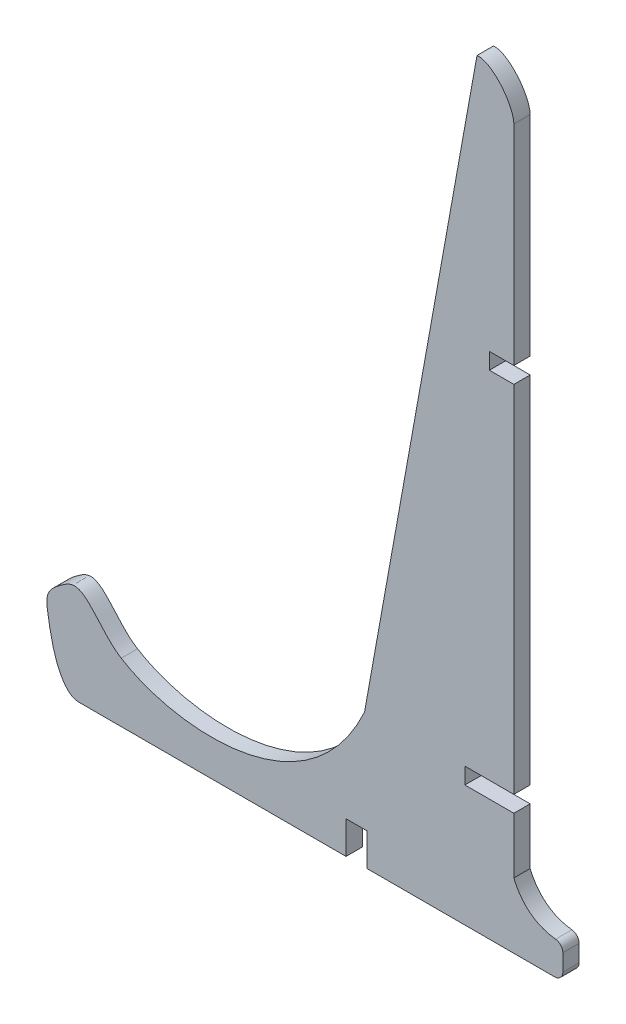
ISO-10303-21;
HEADER;
FILE_DESCRIPTION(('STEP AP214'),'2;1');
FILE_NAME('part.step','',(''),(''),'','','');
FILE_SCHEMA(('AUTOMOTIVE_DESIGN { 1 0 10303 214 1 1 1 1 }'));
ENDSEC;
DATA;
#1=APPLICATION_CONTEXT('core data for automotive mechanical design processes');
#2=APPLICATION_PROTOCOL_DEFINITION('international standard','automotive_design',2000,#1);
#3=PRODUCT_CONTEXT('',#1,'mechanical');
#4=PRODUCT('Part','Part','',(#3));
#5=PRODUCT_RELATED_PRODUCT_CATEGORY('part','',(#4));
#6=PRODUCT_DEFINITION_FORMATION('','',#4);
#7=PRODUCT_DEFINITION_CONTEXT('part definition',#1,'design');
#8=PRODUCT_DEFINITION('design','',#6,#7);
#9=PRODUCT_DEFINITION_SHAPE('','',#8);
#10=(LENGTH_UNIT() NAMED_UNIT(*) SI_UNIT(.MILLI.,.METRE.));
#11=(NAMED_UNIT(*) PLANE_ANGLE_UNIT() SI_UNIT($,.RADIAN.));
#12=(NAMED_UNIT(*) SI_UNIT($,.STERADIAN.) SOLID_ANGLE_UNIT());
#13=UNCERTAINTY_MEASURE_WITH_UNIT(LENGTH_MEASURE(1.E-05),#10,'distance_accuracy_value','');
#14=(GEOMETRIC_REPRESENTATION_CONTEXT(3) GLOBAL_UNCERTAINTY_ASSIGNED_CONTEXT((#13)) GLOBAL_UNIT_ASSIGNED_CONTEXT((#10,
#11,#12)) REPRESENTATION_CONTEXT('',''));
#15=CARTESIAN_POINT('',(0.,0.,0.));
#16=DIRECTION('',(0.,0.,1.));
#17=DIRECTION('',(1.,0.,0.));
#18=AXIS2_PLACEMENT_3D('',#15,#16,#17);
#19=CARTESIAN_POINT('',(-5.00000000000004,0.,10.));
#20=DIRECTION('',(0.,1.,0.));
#21=DIRECTION('',(-1.,0.,0.));
#22=AXIS2_PLACEMENT_3D('',#19,#20,#21);
#23=PLANE('',#22);
#24=DIRECTION('',(1.,0.,0.));
#25=VECTOR('',#24,1.);
#26=CARTESIAN_POINT('',(-5.00000000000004,0.,0.));
#27=LINE('',#26,#25);
#28=CARTESIAN_POINT('',(-296.094580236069,0.,0.));
#29=VERTEX_POINT('',#28);
#30=CARTESIAN_POINT('',(-132.8,0.,0.));
#31=VERTEX_POINT('',#30);
#32=EDGE_CURVE('E206',#29,#31,#27,.T.);
#33=ORIENTED_EDGE('',*,*,#32,.T.);
#34=DIRECTION('',(0.,0.,1.));
#35=VECTOR('',#34,1.);
#36=CARTESIAN_POINT('',(-132.8,0.,0.));
#37=LINE('',#36,#35);
#38=CARTESIAN_POINT('',(-132.8,0.,10.));
#39=VERTEX_POINT('',#38);
#40=EDGE_CURVE('E190',#31,#39,#37,.T.);
#41=ORIENTED_EDGE('',*,*,#40,.T.);
#42=DIRECTION('',(1.,0.,0.));
#43=VECTOR('',#42,1.);
#44=CARTESIAN_POINT('',(-5.00000000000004,0.,10.));
#45=LINE('',#44,#43);
#46=CARTESIAN_POINT('',(-296.094580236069,0.,10.));
#47=VERTEX_POINT('',#46);
#48=EDGE_CURVE('E363',#47,#39,#45,.T.);
#49=ORIENTED_EDGE('',*,*,#48,.F.);
#50=DIRECTION('',(0.,0.,-1.));
#51=VECTOR('',#50,1.);
#52=CARTESIAN_POINT('',(-296.094580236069,0.,10.));
#53=LINE('',#52,#51);
#54=EDGE_CURVE('E213',#47,#29,#53,.T.);
#55=ORIENTED_EDGE('',*,*,#54,.T.);
#56=EDGE_LOOP('',(#33,#41,#49,#55));
#57=FACE_BOUND('',#56,.T.);
#58=ADVANCED_FACE('F34',(#57),#23,.F.);
#59=CARTESIAN_POINT('',(-30.,40.,10.));
#60=DIRECTION('',(-1.,0.,0.));
#61=DIRECTION('',(0.,0.,1.));
#62=AXIS2_PLACEMENT_3D('',#59,#60,#61);
#63=PLANE('',#62);
#64=DIRECTION('',(0.,1.,0.));
#65=VECTOR('',#64,1.);
#66=CARTESIAN_POINT('',(-30.,40.,0.));
#67=LINE('',#66,#65);
#68=CARTESIAN_POINT('',(-30.,40.,0.));
#69=VERTEX_POINT('',#68);
#70=CARTESIAN_POINT('',(-30.,74.3168641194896,0.));
#71=VERTEX_POINT('',#70);
#72=EDGE_CURVE('E231',#69,#71,#67,.T.);
#73=ORIENTED_EDGE('',*,*,#72,.T.);
#74=DIRECTION('',(0.,0.,1.));
#75=VECTOR('',#74,1.);
#76=CARTESIAN_POINT('',(-30.,74.3168641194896,0.));
#77=LINE('',#76,#75);
#78=CARTESIAN_POINT('',(-30.,74.3168641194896,10.));
#79=VERTEX_POINT('',#78);
#80=EDGE_CURVE('E296',#71,#79,#77,.T.);
#81=ORIENTED_EDGE('',*,*,#80,.T.);
#82=DIRECTION('',(0.,1.,0.));
#83=VECTOR('',#82,1.);
#84=CARTESIAN_POINT('',(-30.,40.,10.));
#85=LINE('',#84,#83);
#86=CARTESIAN_POINT('',(-30.,40.,10.));
#87=VERTEX_POINT('',#86);
#88=EDGE_CURVE('E243',#87,#79,#85,.T.);
#89=ORIENTED_EDGE('',*,*,#88,.F.);
#90=DIRECTION('',(0.,0.,-1.));
#91=VECTOR('',#90,1.);
#92=CARTESIAN_POINT('',(-30.,40.,10.));
#93=LINE('',#92,#91);
#94=EDGE_CURVE('E242',#87,#69,#93,.T.);
#95=ORIENTED_EDGE('',*,*,#94,.T.);
#96=EDGE_LOOP('',(#73,#81,#89,#95));
#97=FACE_BOUND('',#96,.T.);
#98=ADVANCED_FACE('F381',(#97),#63,.F.);
#99=CARTESIAN_POINT('',(-30.,84.3168641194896,10.));
#100=VERTEX_POINT('',#99);
#101=CARTESIAN_POINT('',(-30.,301.863689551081,10.));
#102=VERTEX_POINT('',#101);
#103=EDGE_CURVE('E302',#100,#102,#85,.T.);
#104=ORIENTED_EDGE('',*,*,#103,.F.);
#105=DIRECTION('',(0.,0.,1.));
#106=VECTOR('',#105,1.);
#107=CARTESIAN_POINT('',(-30.,84.3168641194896,0.));
#108=LINE('',#107,#106);
#109=CARTESIAN_POINT('',(-30.,84.3168641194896,0.));
#110=VERTEX_POINT('',#109);
#111=EDGE_CURVE('E402',#110,#100,#108,.T.);
#112=ORIENTED_EDGE('',*,*,#111,.F.);
#113=CARTESIAN_POINT('',(-30.,301.863689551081,0.));
#114=VERTEX_POINT('',#113);
#115=EDGE_CURVE('E238',#110,#114,#67,.T.);
#116=ORIENTED_EDGE('',*,*,#115,.T.);
#117=DIRECTION('',(0.,0.,1.));
#118=VECTOR('',#117,1.);
#119=CARTESIAN_POINT('',(-30.,301.863689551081,0.));
#120=LINE('',#119,#118);
#121=EDGE_CURVE('E424',#114,#102,#120,.T.);
#122=ORIENTED_EDGE('',*,*,#121,.T.);
#123=EDGE_LOOP('',(#104,#112,#116,#122));
#124=FACE_BOUND('',#123,.T.);
#125=ADVANCED_FACE('F467',(#124),#63,.F.);
#126=CARTESIAN_POINT('',(-30.,440.,10.));
#127=CARTESIAN_POINT('',(-30.2000133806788,449.899956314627,10.));
#128=CARTESIAN_POINT('',(-43.2967119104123,466.279484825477,10.));
#129=CARTESIAN_POINT('',(-52.5745711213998,465.090015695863,10.));
#130=B_SPLINE_CURVE_WITH_KNOTS('',3,(#126,#127,#128,#129),.UNSPECIFIED.,.F.,.F.,(4,4),(0.,1.),.UNSPECIFIED.);
#131=DIRECTION('',(0.,0.,-1.));
#132=VECTOR('',#131,1.);
#133=SURFACE_OF_LINEAR_EXTRUSION('',#130,#132);
#134=CARTESIAN_POINT('',(-30.,440.,0.));
#135=CARTESIAN_POINT('',(-30.2000133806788,449.899956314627,0.));
#136=CARTESIAN_POINT('',(-43.2967119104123,466.279484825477,0.));
#137=CARTESIAN_POINT('',(-52.5745711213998,465.090015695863,0.));
#138=B_SPLINE_CURVE_WITH_KNOTS('',3,(#134,#135,#136,#137),.UNSPECIFIED.,.F.,.F.,(4,4),(0.,1.),.UNSPECIFIED.);
#139=CARTESIAN_POINT('',(-30.,440.,0.));
#140=VERTEX_POINT('',#139);
#141=CARTESIAN_POINT('',(-52.5745711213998,465.090015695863,0.));
#142=VERTEX_POINT('',#141);
#143=EDGE_CURVE('E279',#140,#142,#138,.T.);
#144=ORIENTED_EDGE('',*,*,#143,.T.);
#145=DIRECTION('',(0.,0.,-1.));
#146=VECTOR('',#145,1.);
#147=CARTESIAN_POINT('',(-52.5745711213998,465.090015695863,10.));
#148=LINE('',#147,#146);
#149=CARTESIAN_POINT('',(-52.5745711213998,465.090015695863,10.));
#150=VERTEX_POINT('',#149);
#151=EDGE_CURVE('E11',#150,#142,#148,.T.);
#152=ORIENTED_EDGE('',*,*,#151,.F.);
#153=CARTESIAN_POINT('',(-30.,440.,10.));
#154=VERTEX_POINT('',#153);
#155=EDGE_CURVE('E237',#154,#150,#130,.T.);
#156=ORIENTED_EDGE('',*,*,#155,.F.);
#157=DIRECTION('',(0.,0.,-1.));
#158=VECTOR('',#157,1.);
#159=CARTESIAN_POINT('',(-30.,440.,10.));
#160=LINE('',#159,#158);
#161=EDGE_CURVE('E239',#154,#140,#160,.T.);
#162=ORIENTED_EDGE('',*,*,#161,.T.);
#163=EDGE_LOOP('',(#144,#152,#156,#162));
#164=FACE_BOUND('',#163,.T.);
#165=ADVANCED_FACE('F36',(#164),#133,.F.);
#166=CARTESIAN_POINT('',(-121.474297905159,82.2554750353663,10.));
#167=DIRECTION('',(0.984188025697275,-0.177126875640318,0.));
#168=DIRECTION('',(0.177126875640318,0.984188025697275,0.));
#169=AXIS2_PLACEMENT_3D('',#166,#167,#168);
#170=PLANE('',#169);
#171=DIRECTION('',(-0.177126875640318,-0.984188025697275,0.));
#172=VECTOR('',#171,1.);
#173=CARTESIAN_POINT('',(-121.474297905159,82.2554750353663,0.));
#174=LINE('',#173,#172);
#175=CARTESIAN_POINT('',(-121.474297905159,82.2554750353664,0.));
#176=VERTEX_POINT('',#175);
#177=EDGE_CURVE('E276',#142,#176,#174,.T.);
#178=ORIENTED_EDGE('',*,*,#177,.T.);
#179=DIRECTION('',(0.,0.,-1.));
#180=VECTOR('',#179,1.);
#181=CARTESIAN_POINT('',(-121.474297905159,82.2554750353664,10.));
#182=LINE('',#181,#180);
#183=CARTESIAN_POINT('',(-121.474297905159,82.2554750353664,10.));
#184=VERTEX_POINT('',#183);
#185=EDGE_CURVE('E43',#184,#176,#182,.T.);
#186=ORIENTED_EDGE('',*,*,#185,.F.);
#187=DIRECTION('',(-0.177126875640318,-0.984188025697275,0.));
#188=VECTOR('',#187,1.);
#189=CARTESIAN_POINT('',(-121.474297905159,82.2554750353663,10.));
#190=LINE('',#189,#188);
#191=EDGE_CURVE('E435',#150,#184,#190,.T.);
#192=ORIENTED_EDGE('',*,*,#191,.F.);
#193=ORIENTED_EDGE('',*,*,#151,.T.);
#194=EDGE_LOOP('',(#178,#186,#192,#193));
#195=FACE_BOUND('',#194,.T.);
#196=ADVANCED_FACE('F480',(#195),#170,.F.);
#197=CARTESIAN_POINT('',(-121.474297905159,82.2554750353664,10.));
#198=CARTESIAN_POINT('',(-155.314196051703,8.32180073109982,10.));
#199=CARTESIAN_POINT('',(-237.12193313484,15.1791710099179,10.));
#200=CARTESIAN_POINT('',(-270.510328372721,36.34298683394,10.));
#201=B_SPLINE_CURVE_WITH_KNOTS('',3,(#197,#198,#199,#200),.UNSPECIFIED.,.F.,.F.,(4,4),(0.,1.),.UNSPECIFIED.);
#202=DIRECTION('',(0.,0.,-1.));
#203=VECTOR('',#202,1.);
#204=SURFACE_OF_LINEAR_EXTRUSION('',#201,#203);
#205=CARTESIAN_POINT('',(-121.474297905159,82.2554750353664,0.));
#206=CARTESIAN_POINT('',(-155.314196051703,8.32180073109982,0.));
#207=CARTESIAN_POINT('',(-237.12193313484,15.1791710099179,0.));
#208=CARTESIAN_POINT('',(-270.510328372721,36.34298683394,0.));
#209=B_SPLINE_CURVE_WITH_KNOTS('',3,(#205,#206,#207,#208),.UNSPECIFIED.,.F.,.F.,(4,4),(0.,1.),.UNSPECIFIED.);
#210=CARTESIAN_POINT('',(-270.510328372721,36.34298683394,0.));
#211=VERTEX_POINT('',#210);
#212=EDGE_CURVE('E271',#176,#211,#209,.T.);
#213=ORIENTED_EDGE('',*,*,#212,.T.);
#214=DIRECTION('',(0.,0.,-1.));
#215=VECTOR('',#214,1.);
#216=CARTESIAN_POINT('',(-270.510328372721,36.34298683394,10.));
#217=LINE('',#216,#215);
#218=CARTESIAN_POINT('',(-270.510328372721,36.34298683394,10.));
#219=VERTEX_POINT('',#218);
#220=EDGE_CURVE('E262',#219,#211,#217,.T.);
#221=ORIENTED_EDGE('',*,*,#220,.F.);
#222=EDGE_CURVE('E272',#184,#219,#201,.T.);
#223=ORIENTED_EDGE('',*,*,#222,.F.);
#224=ORIENTED_EDGE('',*,*,#185,.T.);
#225=EDGE_LOOP('',(#213,#221,#223,#224));
#226=FACE_BOUND('',#225,.T.);
#227=ADVANCED_FACE('F269',(#226),#204,.F.);
#228=CARTESIAN_POINT('',(-270.510328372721,36.34298683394,10.));
#229=CARTESIAN_POINT('',(-282.427783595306,43.3712296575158,10.));
#230=CARTESIAN_POINT('',(-293.009487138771,66.3482725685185,10.));
#231=CARTESIAN_POINT('',(-316.760306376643,50.5589723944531,10.));
#232=CARTESIAN_POINT('',(-317.167872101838,46.009028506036,10.));
#233=CARTESIAN_POINT('',(-312.425113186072,20.4822850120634,10.));
#234=CARTESIAN_POINT('',(-308.578938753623,8.26962731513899,10.));
#235=CARTESIAN_POINT('',(-303.117965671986,2.88156920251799,10.));
#236=B_SPLINE_CURVE_WITH_KNOTS('',3,(#228,#229,#230,#231,#232,#233,#234,#235),.UNSPECIFIED.,.F.,
.F.,(4,1,1,1,1,4),(0.0415446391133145,0.309810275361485,0.380871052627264,0.710898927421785,
0.77693717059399,1.),.UNSPECIFIED.);
#237=DIRECTION('',(0.,0.,-1.));
#238=VECTOR('',#237,1.);
#239=SURFACE_OF_LINEAR_EXTRUSION('',#236,#238);
#240=CARTESIAN_POINT('',(-270.510328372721,36.34298683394,0.));
#241=CARTESIAN_POINT('',(-282.427783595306,43.3712296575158,0.));
#242=CARTESIAN_POINT('',(-293.009487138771,66.3482725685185,0.));
#243=CARTESIAN_POINT('',(-316.760306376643,50.5589723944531,0.));
#244=CARTESIAN_POINT('',(-317.167872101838,46.009028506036,0.));
#245=CARTESIAN_POINT('',(-312.425113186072,20.4822850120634,0.));
#246=CARTESIAN_POINT('',(-308.578938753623,8.26962731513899,0.));
#247=CARTESIAN_POINT('',(-303.117965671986,2.88156920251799,0.));
#248=B_SPLINE_CURVE_WITH_KNOTS('',3,(#240,#241,#242,#243,#244,#245,#246,#247),.UNSPECIFIED.,.F.,
.F.,(4,1,1,1,1,4),(0.0415446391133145,0.309810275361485,0.380871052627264,0.710898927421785,
0.77693717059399,1.),.UNSPECIFIED.);
#249=CARTESIAN_POINT('',(-303.117965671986,2.88156920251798,0.));
#250=VERTEX_POINT('',#249);
#251=EDGE_CURVE('E277',#211,#250,#248,.T.);
#252=ORIENTED_EDGE('',*,*,#251,.T.);
#253=DIRECTION('',(0.,0.,-1.));
#254=VECTOR('',#253,1.);
#255=CARTESIAN_POINT('',(-303.117965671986,2.88156920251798,10.));
#256=LINE('',#255,#254);
#257=CARTESIAN_POINT('',(-303.117965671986,2.88156920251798,10.));
#258=VERTEX_POINT('',#257);
#259=EDGE_CURVE('E259',#258,#250,#256,.T.);
#260=ORIENTED_EDGE('',*,*,#259,.F.);
#261=EDGE_CURVE('E348',#219,#258,#236,.T.);
#262=ORIENTED_EDGE('',*,*,#261,.F.);
#263=ORIENTED_EDGE('',*,*,#220,.T.);
#264=EDGE_LOOP('',(#252,#260,#262,#263));
#265=FACE_BOUND('',#264,.T.);
#266=ADVANCED_FACE('F341',(#265),#239,.F.);
#267=CARTESIAN_POINT('',(-296.094580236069,9.99999999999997,10.));
#268=DIRECTION('',(0.,0.,-1.));
#269=DIRECTION('',(-1.,0.,0.));
#270=AXIS2_PLACEMENT_3D('',#267,#268,#269);
#271=CYLINDRICAL_SURFACE('',#270,10.);
#272=CARTESIAN_POINT('',(-296.094580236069,9.99999999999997,0.));
#273=DIRECTION('',(0.,0.,1.));
#274=DIRECTION('',(-1.,0.,0.));
#275=AXIS2_PLACEMENT_3D('',#272,#273,#274);
#276=CIRCLE('',#275,10.);
#277=EDGE_CURVE('E219',#250,#29,#276,.T.);
#278=ORIENTED_EDGE('',*,*,#277,.T.);
#279=ORIENTED_EDGE('',*,*,#54,.F.);
#280=CARTESIAN_POINT('',(-296.094580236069,9.99999999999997,10.));
#281=DIRECTION('',(0.,0.,1.));
#282=DIRECTION('',(-1.,0.,0.));
#283=AXIS2_PLACEMENT_3D('',#280,#281,#282);
#284=CIRCLE('',#283,10.);
#285=EDGE_CURVE('E353',#258,#47,#284,.T.);
#286=ORIENTED_EDGE('',*,*,#285,.F.);
#287=ORIENTED_EDGE('',*,*,#259,.T.);
#288=EDGE_LOOP('',(#278,#279,#286,#287));
#289=FACE_BOUND('',#288,.T.);
#290=ADVANCED_FACE('F337',(#289),#271,.T.);
#291=CARTESIAN_POINT('',(-120.,0.,10.));
#292=VERTEX_POINT('',#291);
#293=CARTESIAN_POINT('',(-5.00000000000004,0.,10.));
#294=VERTEX_POINT('',#293);
#295=EDGE_CURVE('E362',#292,#294,#45,.T.);
#296=ORIENTED_EDGE('',*,*,#295,.F.);
#297=DIRECTION('',(0.,0.,1.));
#298=VECTOR('',#297,1.);
#299=CARTESIAN_POINT('',(-120.,0.,0.));
#300=LINE('',#299,#298);
#301=CARTESIAN_POINT('',(-120.,0.,0.));
#302=VERTEX_POINT('',#301);
#303=EDGE_CURVE('E200',#302,#292,#300,.T.);
#304=ORIENTED_EDGE('',*,*,#303,.F.);
#305=CARTESIAN_POINT('',(-5.00000000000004,0.,0.));
#306=VERTEX_POINT('',#305);
#307=EDGE_CURVE('E215',#302,#306,#27,.T.);
#308=ORIENTED_EDGE('',*,*,#307,.T.);
#309=DIRECTION('',(0.,0.,-1.));
#310=VECTOR('',#309,1.);
#311=CARTESIAN_POINT('',(-5.00000000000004,0.,10.));
#312=LINE('',#311,#310);
#313=EDGE_CURVE('E255',#294,#306,#312,.T.);
#314=ORIENTED_EDGE('',*,*,#313,.F.);
#315=EDGE_LOOP('',(#296,#304,#308,#314));
#316=FACE_BOUND('',#315,.T.);
#317=ADVANCED_FACE('F333',(#316),#23,.F.);
#318=CARTESIAN_POINT('',(-5.,5.,10.));
#319=DIRECTION('',(0.,0.,-1.));
#320=DIRECTION('',(-1.,0.,0.));
#321=AXIS2_PLACEMENT_3D('',#318,#319,#320);
#322=CYLINDRICAL_SURFACE('',#321,5.);
#323=CARTESIAN_POINT('',(-5.,5.,0.));
#324=DIRECTION('',(0.,0.,1.));
#325=DIRECTION('',(1.,0.,0.));
#326=AXIS2_PLACEMENT_3D('',#323,#324,#325);
#327=CIRCLE('',#326,5.);
#328=CARTESIAN_POINT('',(0.,5.00000000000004,0.));
#329=VERTEX_POINT('',#328);
#330=EDGE_CURVE('E214',#306,#329,#327,.T.);
#331=ORIENTED_EDGE('',*,*,#330,.T.);
#332=DIRECTION('',(0.,0.,-1.));
#333=VECTOR('',#332,1.);
#334=CARTESIAN_POINT('',(0.,5.00000000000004,10.));
#335=LINE('',#334,#333);
#336=CARTESIAN_POINT('',(0.,5.00000000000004,10.));
#337=VERTEX_POINT('',#336);
#338=EDGE_CURVE('E252',#337,#329,#335,.T.);
#339=ORIENTED_EDGE('',*,*,#338,.F.);
#340=CARTESIAN_POINT('',(-5.,5.,10.));
#341=DIRECTION('',(0.,0.,1.));
#342=DIRECTION('',(1.,0.,0.));
#343=AXIS2_PLACEMENT_3D('',#340,#341,#342);
#344=CIRCLE('',#343,5.);
#345=EDGE_CURVE('E365',#294,#337,#344,.T.);
#346=ORIENTED_EDGE('',*,*,#345,.F.);
#347=ORIENTED_EDGE('',*,*,#313,.T.);
#348=EDGE_LOOP('',(#331,#339,#346,#347));
#349=FACE_BOUND('',#348,.T.);
#350=ADVANCED_FACE('F329',(#349),#322,.T.);
#351=CARTESIAN_POINT('',(0.,15.3046623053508,10.));
#352=DIRECTION('',(-1.,0.,0.));
#353=DIRECTION('',(0.,-1.,0.));
#354=AXIS2_PLACEMENT_3D('',#351,#352,#353);
#355=PLANE('',#354);
#356=DIRECTION('',(0.,1.,0.));
#357=VECTOR('',#356,1.);
#358=CARTESIAN_POINT('',(0.,15.3046623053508,0.));
#359=LINE('',#358,#357);
#360=CARTESIAN_POINT('',(0.,15.3046623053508,0.));
#361=VERTEX_POINT('',#360);
#362=EDGE_CURVE('E217',#329,#361,#359,.T.);
#363=ORIENTED_EDGE('',*,*,#362,.T.);
#364=DIRECTION('',(0.,0.,-1.));
#365=VECTOR('',#364,1.);
#366=CARTESIAN_POINT('',(0.,15.3046623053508,10.));
#367=LINE('',#366,#365);
#368=CARTESIAN_POINT('',(0.,15.3046623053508,10.));
#369=VERTEX_POINT('',#368);
#370=EDGE_CURVE('E249',#369,#361,#367,.T.);
#371=ORIENTED_EDGE('',*,*,#370,.F.);
#372=DIRECTION('',(0.,1.,0.));
#373=VECTOR('',#372,1.);
#374=CARTESIAN_POINT('',(0.,15.3046623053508,10.));
#375=LINE('',#374,#373);
#376=EDGE_CURVE('E366',#337,#369,#375,.T.);
#377=ORIENTED_EDGE('',*,*,#376,.F.);
#378=ORIENTED_EDGE('',*,*,#338,.T.);
#379=EDGE_LOOP('',(#363,#371,#377,#378));
#380=FACE_BOUND('',#379,.T.);
#381=ADVANCED_FACE('F325',(#380),#355,.F.);
#382=CARTESIAN_POINT('',(-5.,15.3046623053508,10.));
#383=DIRECTION('',(0.,0.,-1.));
#384=DIRECTION('',(-1.,0.,0.));
#385=AXIS2_PLACEMENT_3D('',#382,#383,#384);
#386=CYLINDRICAL_SURFACE('',#385,5.);
#387=CARTESIAN_POINT('',(-5.,15.3046623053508,0.));
#388=DIRECTION('',(0.,0.,1.));
#389=DIRECTION('',(-1.,0.,0.));
#390=AXIS2_PLACEMENT_3D('',#387,#388,#389);
#391=CIRCLE('',#390,5.);
#392=CARTESIAN_POINT('',(-4.42190381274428,20.2711303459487,0.));
#393=VERTEX_POINT('',#392);
#394=EDGE_CURVE('E224',#361,#393,#391,.T.);
#395=ORIENTED_EDGE('',*,*,#394,.T.);
#396=DIRECTION('',(0.,0.,-1.));
#397=VECTOR('',#396,1.);
#398=CARTESIAN_POINT('',(-4.42190381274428,20.2711303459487,10.));
#399=LINE('',#398,#397);
#400=CARTESIAN_POINT('',(-4.42190381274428,20.2711303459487,10.));
#401=VERTEX_POINT('',#400);
#402=EDGE_CURVE('E246',#401,#393,#399,.T.);
#403=ORIENTED_EDGE('',*,*,#402,.F.);
#404=CARTESIAN_POINT('',(-5.,15.3046623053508,10.));
#405=DIRECTION('',(0.,0.,1.));
#406=DIRECTION('',(-1.,0.,0.));
#407=AXIS2_PLACEMENT_3D('',#404,#405,#406);
#408=CIRCLE('',#407,5.);
#409=EDGE_CURVE('E309',#369,#401,#408,.T.);
#410=ORIENTED_EDGE('',*,*,#409,.F.);
#411=ORIENTED_EDGE('',*,*,#370,.T.);
#412=EDGE_LOOP('',(#395,#403,#410,#411));
#413=FACE_BOUND('',#412,.T.);
#414=ADVANCED_FACE('F320',(#413),#386,.T.);
#415=CARTESIAN_POINT('',(-4.42190381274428,20.2711303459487,10.));
#416=CARTESIAN_POINT('',(-16.2475440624,21.6476332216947,10.));
#417=CARTESIAN_POINT('',(-25.2006603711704,28.4801448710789,10.));
#418=CARTESIAN_POINT('',(-30.,40.,10.));
#419=B_SPLINE_CURVE_WITH_KNOTS('',3,(#415,#416,#417,#418),.UNSPECIFIED.,.F.,.F.,(4,4),
(0.107608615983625,1.),.UNSPECIFIED.);
#420=DIRECTION('',(0.,0.,-1.));
#421=VECTOR('',#420,1.);
#422=SURFACE_OF_LINEAR_EXTRUSION('',#419,#421);
#423=CARTESIAN_POINT('',(-4.42190381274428,20.2711303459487,0.));
#424=CARTESIAN_POINT('',(-16.2475440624,21.6476332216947,0.));
#425=CARTESIAN_POINT('',(-25.2006603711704,28.4801448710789,0.));
#426=CARTESIAN_POINT('',(-30.,40.,0.));
#427=B_SPLINE_CURVE_WITH_KNOTS('',3,(#423,#424,#425,#426),.UNSPECIFIED.,.F.,.F.,(4,4),
(0.107608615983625,1.),.UNSPECIFIED.);
#428=EDGE_CURVE('E226',#393,#69,#427,.T.);
#429=ORIENTED_EDGE('',*,*,#428,.T.);
#430=ORIENTED_EDGE('',*,*,#94,.F.);
#431=EDGE_CURVE('E304',#401,#87,#419,.T.);
#432=ORIENTED_EDGE('',*,*,#431,.F.);
#433=ORIENTED_EDGE('',*,*,#402,.T.);
#434=EDGE_LOOP('',(#429,#430,#432,#433));
#435=FACE_BOUND('',#434,.T.);
#436=ADVANCED_FACE('F315',(#435),#422,.F.);
#437=CARTESIAN_POINT('',(-30.,311.863689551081,10.));
#438=VERTEX_POINT('',#437);
#439=EDGE_CURVE('E303',#438,#154,#85,.T.);
#440=ORIENTED_EDGE('',*,*,#439,.F.);
#441=DIRECTION('',(0.,0.,1.));
#442=VECTOR('',#441,1.);
#443=CARTESIAN_POINT('',(-30.,311.863689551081,0.));
#444=LINE('',#443,#442);
#445=CARTESIAN_POINT('',(-30.,311.863689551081,0.));
#446=VERTEX_POINT('',#445);
#447=EDGE_CURVE('E415',#446,#438,#444,.T.);
#448=ORIENTED_EDGE('',*,*,#447,.F.);
#449=EDGE_CURVE('E230',#446,#140,#67,.T.);
#450=ORIENTED_EDGE('',*,*,#449,.T.);
#451=ORIENTED_EDGE('',*,*,#161,.F.);
#452=EDGE_LOOP('',(#440,#448,#450,#451));
#453=FACE_BOUND('',#452,.T.);
#454=ADVANCED_FACE('F319',(#453),#63,.F.);
#455=CARTESIAN_POINT('',(-37.8830933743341,456.703542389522,10.));
#456=DIRECTION('',(0.,0.,1.));
#457=DIRECTION('',(1.,0.,0.));
#458=AXIS2_PLACEMENT_3D('',#455,#456,#457);
#459=PLANE('',#458);
#460=DIRECTION('',(0.,-1.,0.));
#461=VECTOR('',#460,1.);
#462=CARTESIAN_POINT('',(-132.8,0.,10.));
#463=LINE('',#462,#461);
#464=CARTESIAN_POINT('',(-132.8,20.,10.));
#465=VERTEX_POINT('',#464);
#466=EDGE_CURVE('E195',#465,#39,#463,.T.);
#467=ORIENTED_EDGE('',*,*,#466,.F.);
#468=DIRECTION('',(-1.,0.,0.));
#469=VECTOR('',#468,1.);
#470=CARTESIAN_POINT('',(-132.8,20.,10.));
#471=LINE('',#470,#469);
#472=CARTESIAN_POINT('',(-120.,20.,10.));
#473=VERTEX_POINT('',#472);
#474=EDGE_CURVE('E209',#473,#465,#471,.T.);
#475=ORIENTED_EDGE('',*,*,#474,.F.);
#476=DIRECTION('',(0.,1.,0.));
#477=VECTOR('',#476,1.);
#478=CARTESIAN_POINT('',(-120.,0.,10.));
#479=LINE('',#478,#477);
#480=EDGE_CURVE('E445',#292,#473,#479,.T.);
#481=ORIENTED_EDGE('',*,*,#480,.F.);
#482=ORIENTED_EDGE('',*,*,#295,.T.);
#483=ORIENTED_EDGE('',*,*,#345,.T.);
#484=ORIENTED_EDGE('',*,*,#376,.T.);
#485=ORIENTED_EDGE('',*,*,#409,.T.);
#486=ORIENTED_EDGE('',*,*,#431,.T.);
#487=ORIENTED_EDGE('',*,*,#88,.T.);
#488=DIRECTION('',(1.,0.,0.));
#489=VECTOR('',#488,1.);
#490=CARTESIAN_POINT('',(-30.,74.3168641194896,10.));
#491=LINE('',#490,#489);
#492=CARTESIAN_POINT('',(-60.,74.3168641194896,10.));
#493=VERTEX_POINT('',#492);
#494=EDGE_CURVE('E384',#493,#79,#491,.T.);
#495=ORIENTED_EDGE('',*,*,#494,.F.);
#496=DIRECTION('',(0.,-1.,0.));
#497=VECTOR('',#496,1.);
#498=CARTESIAN_POINT('',(-60.,84.3168641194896,10.));
#499=LINE('',#498,#497);
#500=CARTESIAN_POINT('',(-60.,84.3168641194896,10.));
#501=VERTEX_POINT('',#500);
#502=EDGE_CURVE('E387',#501,#493,#499,.T.);
#503=ORIENTED_EDGE('',*,*,#502,.F.);
#504=DIRECTION('',(-1.,0.,0.));
#505=VECTOR('',#504,1.);
#506=CARTESIAN_POINT('',(-30.,84.3168641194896,10.));
#507=LINE('',#506,#505);
#508=EDGE_CURVE('E393',#100,#501,#507,.T.);
#509=ORIENTED_EDGE('',*,*,#508,.F.);
#510=ORIENTED_EDGE('',*,*,#103,.T.);
#511=DIRECTION('',(1.,0.,0.));
#512=VECTOR('',#511,1.);
#513=CARTESIAN_POINT('',(-30.,301.863689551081,10.));
#514=LINE('',#513,#512);
#515=CARTESIAN_POINT('',(-45.,301.863689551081,10.));
#516=VERTEX_POINT('',#515);
#517=EDGE_CURVE('E409',#516,#102,#514,.T.);
#518=ORIENTED_EDGE('',*,*,#517,.F.);
#519=DIRECTION('',(0.,-1.,0.));
#520=VECTOR('',#519,1.);
#521=CARTESIAN_POINT('',(-45.,311.863689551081,10.));
#522=LINE('',#521,#520);
#523=CARTESIAN_POINT('',(-45.,311.863689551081,10.));
#524=VERTEX_POINT('',#523);
#525=EDGE_CURVE('E419',#524,#516,#522,.T.);
#526=ORIENTED_EDGE('',*,*,#525,.F.);
#527=DIRECTION('',(-1.,0.,0.));
#528=VECTOR('',#527,1.);
#529=CARTESIAN_POINT('',(-30.,311.863689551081,10.));
#530=LINE('',#529,#528);
#531=EDGE_CURVE('E416',#438,#524,#530,.T.);
#532=ORIENTED_EDGE('',*,*,#531,.F.);
#533=ORIENTED_EDGE('',*,*,#439,.T.);
#534=ORIENTED_EDGE('',*,*,#155,.T.);
#535=ORIENTED_EDGE('',*,*,#191,.T.);
#536=ORIENTED_EDGE('',*,*,#222,.T.);
#537=ORIENTED_EDGE('',*,*,#261,.T.);
#538=ORIENTED_EDGE('',*,*,#285,.T.);
#539=ORIENTED_EDGE('',*,*,#48,.T.);
#540=EDGE_LOOP('',(#467,#475,#481,#482,#483,#484,#485,#486,#487,#495,#503,#509,#510,#518,#526,
#532,#533,#534,#535,#536,#537,#538,#539));
#541=FACE_BOUND('',#540,.T.);
#542=ADVANCED_FACE('F372',(#541),#459,.T.);
#543=CARTESIAN_POINT('',(-37.8830933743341,456.703542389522,0.));
#544=DIRECTION('',(0.,0.,1.));
#545=DIRECTION('',(1.,0.,0.));
#546=AXIS2_PLACEMENT_3D('',#543,#544,#545);
#547=PLANE('',#546);
#548=DIRECTION('',(-1.,0.,0.));
#549=VECTOR('',#548,1.);
#550=CARTESIAN_POINT('',(-132.8,20.,0.));
#551=LINE('',#550,#549);
#552=CARTESIAN_POINT('',(-120.,20.,0.));
#553=VERTEX_POINT('',#552);
#554=CARTESIAN_POINT('',(-132.8,20.,0.));
#555=VERTEX_POINT('',#554);
#556=EDGE_CURVE('E50',#553,#555,#551,.T.);
#557=ORIENTED_EDGE('',*,*,#556,.T.);
#558=DIRECTION('',(0.,-1.,0.));
#559=VECTOR('',#558,1.);
#560=CARTESIAN_POINT('',(-132.8,0.,0.));
#561=LINE('',#560,#559);
#562=EDGE_CURVE('E193',#555,#31,#561,.T.);
#563=ORIENTED_EDGE('',*,*,#562,.T.);
#564=ORIENTED_EDGE('',*,*,#32,.F.);
#565=ORIENTED_EDGE('',*,*,#277,.F.);
#566=ORIENTED_EDGE('',*,*,#251,.F.);
#567=ORIENTED_EDGE('',*,*,#212,.F.);
#568=ORIENTED_EDGE('',*,*,#177,.F.);
#569=ORIENTED_EDGE('',*,*,#143,.F.);
#570=ORIENTED_EDGE('',*,*,#449,.F.);
#571=DIRECTION('',(-1.,0.,0.));
#572=VECTOR('',#571,1.);
#573=CARTESIAN_POINT('',(-30.,311.863689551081,0.));
#574=LINE('',#573,#572);
#575=CARTESIAN_POINT('',(-45.,311.863689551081,0.));
#576=VERTEX_POINT('',#575);
#577=EDGE_CURVE('E405',#446,#576,#574,.T.);
#578=ORIENTED_EDGE('',*,*,#577,.T.);
#579=DIRECTION('',(0.,-1.,0.));
#580=VECTOR('',#579,1.);
#581=CARTESIAN_POINT('',(-45.,311.863689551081,0.));
#582=LINE('',#581,#580);
#583=CARTESIAN_POINT('',(-45.,301.863689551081,0.));
#584=VERTEX_POINT('',#583);
#585=EDGE_CURVE('E408',#576,#584,#582,.T.);
#586=ORIENTED_EDGE('',*,*,#585,.T.);
#587=DIRECTION('',(1.,0.,0.));
#588=VECTOR('',#587,1.);
#589=CARTESIAN_POINT('',(-30.,301.863689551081,0.));
#590=LINE('',#589,#588);
#591=EDGE_CURVE('E412',#584,#114,#590,.T.);
#592=ORIENTED_EDGE('',*,*,#591,.T.);
#593=ORIENTED_EDGE('',*,*,#115,.F.);
#594=DIRECTION('',(-1.,0.,0.));
#595=VECTOR('',#594,1.);
#596=CARTESIAN_POINT('',(-30.,84.3168641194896,0.));
#597=LINE('',#596,#595);
#598=CARTESIAN_POINT('',(-60.,84.3168641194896,0.));
#599=VERTEX_POINT('',#598);
#600=EDGE_CURVE('E389',#110,#599,#597,.T.);
#601=ORIENTED_EDGE('',*,*,#600,.T.);
#602=DIRECTION('',(0.,-1.,0.));
#603=VECTOR('',#602,1.);
#604=CARTESIAN_POINT('',(-60.,84.3168641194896,0.));
#605=LINE('',#604,#603);
#606=CARTESIAN_POINT('',(-60.,74.3168641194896,0.));
#607=VERTEX_POINT('',#606);
#608=EDGE_CURVE('E58',#599,#607,#605,.T.);
#609=ORIENTED_EDGE('',*,*,#608,.T.);
#610=DIRECTION('',(1.,0.,0.));
#611=VECTOR('',#610,1.);
#612=CARTESIAN_POINT('',(-30.,74.3168641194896,0.));
#613=LINE('',#612,#611);
#614=EDGE_CURVE('E404',#607,#71,#613,.T.);
#615=ORIENTED_EDGE('',*,*,#614,.T.);
#616=ORIENTED_EDGE('',*,*,#72,.F.);
#617=ORIENTED_EDGE('',*,*,#428,.F.);
#618=ORIENTED_EDGE('',*,*,#394,.F.);
#619=ORIENTED_EDGE('',*,*,#362,.F.);
#620=ORIENTED_EDGE('',*,*,#330,.F.);
#621=ORIENTED_EDGE('',*,*,#307,.F.);
#622=DIRECTION('',(0.,1.,0.));
#623=VECTOR('',#622,1.);
#624=CARTESIAN_POINT('',(-120.,0.,0.));
#625=LINE('',#624,#623);
#626=EDGE_CURVE('E208',#302,#553,#625,.T.);
#627=ORIENTED_EDGE('',*,*,#626,.T.);
#628=EDGE_LOOP('',(#557,#563,#564,#565,#566,#567,#568,#569,#570,#578,#586,#592,#593,#601,#609,
#615,#616,#617,#618,#619,#620,#621,#627));
#629=FACE_BOUND('',#628,.T.);
#630=ADVANCED_FACE('F204',(#629),#547,.F.);
#631=CARTESIAN_POINT('',(-30.,301.863689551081,0.));
#632=DIRECTION('',(0.,-1.,0.));
#633=DIRECTION('',(0.,0.,-1.));
#634=AXIS2_PLACEMENT_3D('',#631,#632,#633);
#635=PLANE('',#634);
#636=ORIENTED_EDGE('',*,*,#517,.T.);
#637=ORIENTED_EDGE('',*,*,#121,.F.);
#638=ORIENTED_EDGE('',*,*,#591,.F.);
#639=DIRECTION('',(0.,0.,1.));
#640=VECTOR('',#639,1.);
#641=CARTESIAN_POINT('',(-45.,301.863689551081,0.));
#642=LINE('',#641,#640);
#643=EDGE_CURVE('E427',#584,#516,#642,.T.);
#644=ORIENTED_EDGE('',*,*,#643,.T.);
#645=EDGE_LOOP('',(#636,#637,#638,#644));
#646=FACE_BOUND('',#645,.T.);
#647=ADVANCED_FACE('F502',(#646),#635,.F.);
#648=CARTESIAN_POINT('',(-45.,311.863689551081,0.));
#649=DIRECTION('',(-1.,0.,0.));
#650=DIRECTION('',(0.,0.,1.));
#651=AXIS2_PLACEMENT_3D('',#648,#649,#650);
#652=PLANE('',#651);
#653=ORIENTED_EDGE('',*,*,#525,.T.);
#654=ORIENTED_EDGE('',*,*,#643,.F.);
#655=ORIENTED_EDGE('',*,*,#585,.F.);
#656=DIRECTION('',(0.,0.,1.));
#657=VECTOR('',#656,1.);
#658=CARTESIAN_POINT('',(-45.,311.863689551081,0.));
#659=LINE('',#658,#657);
#660=EDGE_CURVE('E429',#576,#524,#659,.T.);
#661=ORIENTED_EDGE('',*,*,#660,.T.);
#662=EDGE_LOOP('',(#653,#654,#655,#661));
#663=FACE_BOUND('',#662,.T.);
#664=ADVANCED_FACE('F508',(#663),#652,.F.);
#665=CARTESIAN_POINT('',(-30.,311.863689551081,0.));
#666=DIRECTION('',(0.,1.,0.));
#667=DIRECTION('',(0.,0.,1.));
#668=AXIS2_PLACEMENT_3D('',#665,#666,#667);
#669=PLANE('',#668);
#670=ORIENTED_EDGE('',*,*,#531,.T.);
#671=ORIENTED_EDGE('',*,*,#660,.F.);
#672=ORIENTED_EDGE('',*,*,#577,.F.);
#673=ORIENTED_EDGE('',*,*,#447,.T.);
#674=EDGE_LOOP('',(#670,#671,#672,#673));
#675=FACE_BOUND('',#674,.T.);
#676=ADVANCED_FACE('F504',(#675),#669,.F.);
#677=CARTESIAN_POINT('',(-30.,74.3168641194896,0.));
#678=DIRECTION('',(0.,-1.,0.));
#679=DIRECTION('',(1.,0.,0.));
#680=AXIS2_PLACEMENT_3D('',#677,#678,#679);
#681=PLANE('',#680);
#682=ORIENTED_EDGE('',*,*,#494,.T.);
#683=ORIENTED_EDGE('',*,*,#80,.F.);
#684=ORIENTED_EDGE('',*,*,#614,.F.);
#685=DIRECTION('',(0.,0.,1.));
#686=VECTOR('',#685,1.);
#687=CARTESIAN_POINT('',(-60.,74.3168641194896,0.));
#688=LINE('',#687,#686);
#689=EDGE_CURVE('E398',#607,#493,#688,.T.);
#690=ORIENTED_EDGE('',*,*,#689,.T.);
#691=EDGE_LOOP('',(#682,#683,#684,#690));
#692=FACE_BOUND('',#691,.T.);
#693=ADVANCED_FACE('F507',(#692),#681,.F.);
#694=CARTESIAN_POINT('',(-60.,84.3168641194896,0.));
#695=DIRECTION('',(-1.,0.,0.));
#696=DIRECTION('',(0.,0.,1.));
#697=AXIS2_PLACEMENT_3D('',#694,#695,#696);
#698=PLANE('',#697);
#699=ORIENTED_EDGE('',*,*,#502,.T.);
#700=ORIENTED_EDGE('',*,*,#689,.F.);
#701=ORIENTED_EDGE('',*,*,#608,.F.);
#702=DIRECTION('',(0.,0.,1.));
#703=VECTOR('',#702,1.);
#704=CARTESIAN_POINT('',(-60.,84.3168641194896,0.));
#705=LINE('',#704,#703);
#706=EDGE_CURVE('E400',#599,#501,#705,.T.);
#707=ORIENTED_EDGE('',*,*,#706,.T.);
#708=EDGE_LOOP('',(#699,#700,#701,#707));
#709=FACE_BOUND('',#708,.T.);
#710=ADVANCED_FACE('F518',(#709),#698,.F.);
#711=CARTESIAN_POINT('',(-30.,84.3168641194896,0.));
#712=DIRECTION('',(0.,1.,0.));
#713=DIRECTION('',(0.,0.,1.));
#714=AXIS2_PLACEMENT_3D('',#711,#712,#713);
#715=PLANE('',#714);
#716=ORIENTED_EDGE('',*,*,#508,.T.);
#717=ORIENTED_EDGE('',*,*,#706,.F.);
#718=ORIENTED_EDGE('',*,*,#600,.F.);
#719=ORIENTED_EDGE('',*,*,#111,.T.);
#720=EDGE_LOOP('',(#716,#717,#718,#719));
#721=FACE_BOUND('',#720,.T.);
#722=ADVANCED_FACE('F461',(#721),#715,.F.);
#723=CARTESIAN_POINT('',(-132.8,0.,0.));
#724=DIRECTION('',(-1.,0.,0.));
#725=DIRECTION('',(0.,0.,1.));
#726=AXIS2_PLACEMENT_3D('',#723,#724,#725);
#727=PLANE('',#726);
#728=ORIENTED_EDGE('',*,*,#466,.T.);
#729=ORIENTED_EDGE('',*,*,#40,.F.);
#730=ORIENTED_EDGE('',*,*,#562,.F.);
#731=DIRECTION('',(0.,0.,1.));
#732=VECTOR('',#731,1.);
#733=CARTESIAN_POINT('',(-132.8,20.,0.));
#734=LINE('',#733,#732);
#735=EDGE_CURVE('E420',#555,#465,#734,.T.);
#736=ORIENTED_EDGE('',*,*,#735,.T.);
#737=EDGE_LOOP('',(#728,#729,#730,#736));
#738=FACE_BOUND('',#737,.T.);
#739=ADVANCED_FACE('F192',(#738),#727,.F.);
#740=CARTESIAN_POINT('',(-132.8,20.,0.));
#741=DIRECTION('',(0.,1.,0.));
#742=DIRECTION('',(0.,0.,1.));
#743=AXIS2_PLACEMENT_3D('',#740,#741,#742);
#744=PLANE('',#743);
#745=ORIENTED_EDGE('',*,*,#474,.T.);
#746=ORIENTED_EDGE('',*,*,#735,.F.);
#747=ORIENTED_EDGE('',*,*,#556,.F.);
#748=DIRECTION('',(0.,0.,1.));
#749=VECTOR('',#748,1.);
#750=CARTESIAN_POINT('',(-120.,20.,0.));
#751=LINE('',#750,#749);
#752=EDGE_CURVE('E454',#553,#473,#751,.T.);
#753=ORIENTED_EDGE('',*,*,#752,.T.);
#754=EDGE_LOOP('',(#745,#746,#747,#753));
#755=FACE_BOUND('',#754,.T.);
#756=ADVANCED_FACE('F525',(#755),#744,.F.);
#757=CARTESIAN_POINT('',(-120.,0.,0.));
#758=DIRECTION('',(1.,0.,0.));
#759=DIRECTION('',(0.,0.,-1.));
#760=AXIS2_PLACEMENT_3D('',#757,#758,#759);
#761=PLANE('',#760);
#762=ORIENTED_EDGE('',*,*,#480,.T.);
#763=ORIENTED_EDGE('',*,*,#752,.F.);
#764=ORIENTED_EDGE('',*,*,#626,.F.);
#765=ORIENTED_EDGE('',*,*,#303,.T.);
#766=EDGE_LOOP('',(#762,#763,#764,#765));
#767=FACE_BOUND('',#766,.T.);
#768=ADVANCED_FACE('F526',(#767),#761,.F.);
#769=CLOSED_SHELL('',(#58,#98,#125,#165,#196,#227,#266,#290,#317,#350,#381,#414,#436,#454,#542,
#630,#647,#664,#676,#693,#710,#722,#739,#756,#768));
#770=MANIFOLD_SOLID_BREP('B2',#769);
#771=ADVANCED_BREP_SHAPE_REPRESENTATION('',(#18,#770),#14);
#772=SHAPE_DEFINITION_REPRESENTATION(#9,#771);
ENDSEC;
END-ISO-10303-21;
